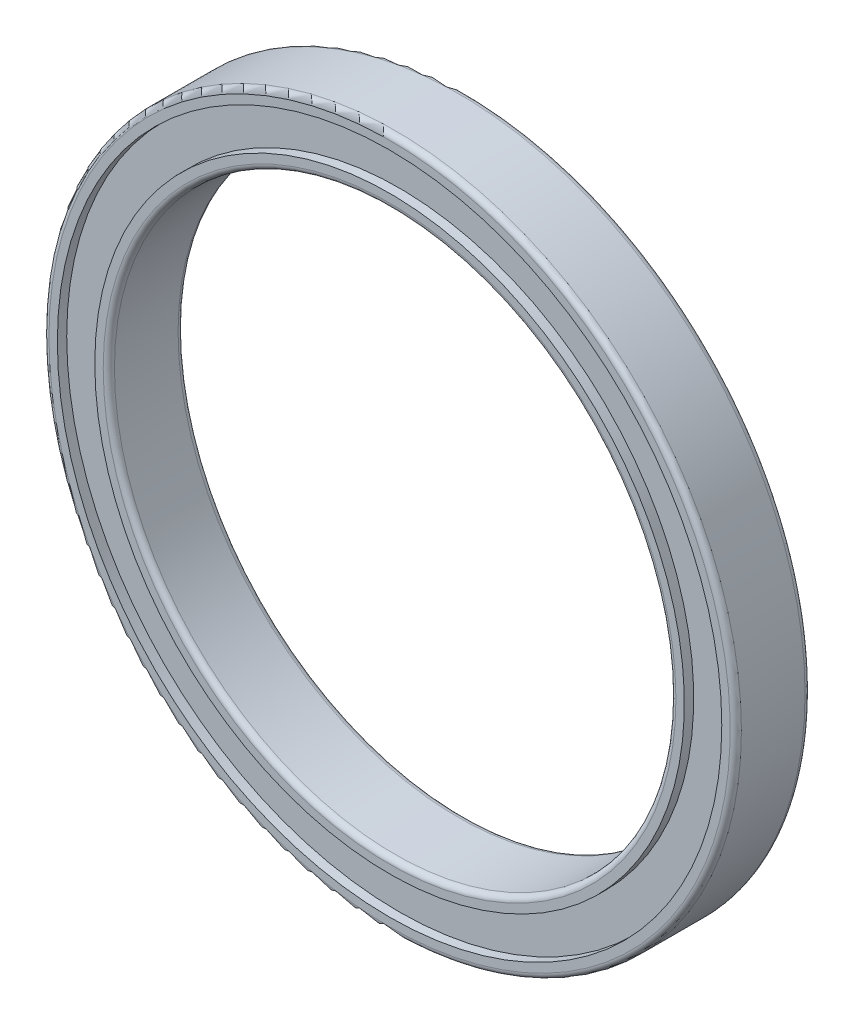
ISO-10303-21;
HEADER;
FILE_DESCRIPTION(('STEP AP214'),'2;1');
FILE_NAME('part.step','',(''),(''),'','','');
FILE_SCHEMA(('AUTOMOTIVE_DESIGN { 1 0 10303 214 1 1 1 1 }'));
ENDSEC;
DATA;
#1=APPLICATION_CONTEXT('core data for automotive mechanical design processes');
#2=APPLICATION_PROTOCOL_DEFINITION('international standard','automotive_design',2000,#1);
#3=PRODUCT_CONTEXT('',#1,'mechanical');
#4=PRODUCT('Part','Part','',(#3));
#5=PRODUCT_RELATED_PRODUCT_CATEGORY('part','',(#4));
#6=PRODUCT_DEFINITION_FORMATION('','',#4);
#7=PRODUCT_DEFINITION_CONTEXT('part definition',#1,'design');
#8=PRODUCT_DEFINITION('design','',#6,#7);
#9=PRODUCT_DEFINITION_SHAPE('','',#8);
#10=(LENGTH_UNIT() NAMED_UNIT(*) SI_UNIT(.MILLI.,.METRE.));
#11=(NAMED_UNIT(*) PLANE_ANGLE_UNIT() SI_UNIT($,.RADIAN.));
#12=(NAMED_UNIT(*) SI_UNIT($,.STERADIAN.) SOLID_ANGLE_UNIT());
#13=UNCERTAINTY_MEASURE_WITH_UNIT(LENGTH_MEASURE(1.E-05),#10,'distance_accuracy_value','');
#14=(GEOMETRIC_REPRESENTATION_CONTEXT(3) GLOBAL_UNCERTAINTY_ASSIGNED_CONTEXT((#13)) GLOBAL_UNIT_ASSIGNED_CONTEXT((#10,
#11,#12)) REPRESENTATION_CONTEXT('',''));
#15=CARTESIAN_POINT('',(0.,0.,0.));
#16=DIRECTION('',(0.,0.,1.));
#17=DIRECTION('',(1.,0.,0.));
#18=AXIS2_PLACEMENT_3D('',#15,#16,#17);
#19=CARTESIAN_POINT('',(0.,0.,0.3));
#20=DIRECTION('',(0.,0.,1.));
#21=DIRECTION('',(1.,0.,0.));
#22=AXIS2_PLACEMENT_3D('',#19,#20,#21);
#23=TOROIDAL_SURFACE('',#22,18.2,0.3);
#24=CARTESIAN_POINT('',(0.,0.,0.3));
#25=DIRECTION('',(0.,0.,1.));
#26=DIRECTION('',(1.,0.,0.));
#27=AXIS2_PLACEMENT_3D('',#24,#25,#26);
#28=CIRCLE('',#27,18.5);
#29=CARTESIAN_POINT('',(-18.5,0.,0.3));
#30=VERTEX_POINT('',#29);
#31=CARTESIAN_POINT('',(18.5,0.,0.3));
#32=VERTEX_POINT('',#31);
#33=EDGE_CURVE('E488',#30,#32,#28,.T.);
#34=ORIENTED_EDGE('',*,*,#33,.F.);
#35=CARTESIAN_POINT('',(-18.2,0.,0.3));
#36=DIRECTION('',(0.,-1.,0.));
#37=DIRECTION('',(-1.,0.,0.));
#38=AXIS2_PLACEMENT_3D('',#35,#36,#37);
#39=CIRCLE('',#38,0.3);
#40=CARTESIAN_POINT('',(-18.2,0.,0.));
#41=VERTEX_POINT('',#40);
#42=EDGE_CURVE('E11',#30,#41,#39,.T.);
#43=ORIENTED_EDGE('',*,*,#42,.T.);
#44=CARTESIAN_POINT('',(0.,0.,0.));
#45=DIRECTION('',(0.,0.,1.));
#46=DIRECTION('',(-1.,0.,0.));
#47=AXIS2_PLACEMENT_3D('',#44,#45,#46);
#48=CIRCLE('',#47,18.2);
#49=EDGE_CURVE('E25',#41,#41,#48,.T.);
#50=ORIENTED_EDGE('',*,*,#49,.T.);
#51=ORIENTED_EDGE('',*,*,#42,.F.);
#52=CARTESIAN_POINT('',(0.,0.,0.3));
#53=DIRECTION('',(0.,0.,1.));
#54=DIRECTION('',(1.,0.,0.));
#55=AXIS2_PLACEMENT_3D('',#52,#53,#54);
#56=CIRCLE('',#55,18.5);
#57=EDGE_CURVE('E270',#32,#30,#56,.T.);
#58=ORIENTED_EDGE('',*,*,#57,.F.);
#59=EDGE_LOOP('',(#34,#43,#50,#51,#58));
#60=FACE_BOUND('',#59,.T.);
#61=ADVANCED_FACE('F17',(#60),#23,.T.);
#62=CARTESIAN_POINT('',(0.,0.,0.));
#63=DIRECTION('',(0.,0.,1.));
#64=DIRECTION('',(1.,0.,0.));
#65=AXIS2_PLACEMENT_3D('',#62,#63,#64);
#66=PLANE('',#65);
#67=CARTESIAN_POINT('',(0.,0.,0.));
#68=DIRECTION('',(0.,0.,-1.));
#69=DIRECTION('',(1.,0.,0.));
#70=AXIS2_PLACEMENT_3D('',#67,#68,#69);
#71=CIRCLE('',#70,17.75);
#72=CARTESIAN_POINT('',(17.75,0.,0.));
#73=VERTEX_POINT('',#72);
#74=EDGE_CURVE('E44',#73,#73,#71,.T.);
#75=ORIENTED_EDGE('',*,*,#74,.F.);
#76=EDGE_LOOP('',(#75));
#77=FACE_BOUND('',#76,.T.);
#78=ORIENTED_EDGE('',*,*,#49,.F.);
#79=EDGE_LOOP('',(#78));
#80=FACE_BOUND('',#79,.T.);
#81=ADVANCED_FACE('F188',(#77,#80),#66,.F.);
#82=CARTESIAN_POINT('',(0.,0.,0.5));
#83=DIRECTION('',(0.,0.,-1.));
#84=DIRECTION('',(-1.,0.,0.));
#85=AXIS2_PLACEMENT_3D('',#82,#83,#84);
#86=CYLINDRICAL_SURFACE('',#85,17.75);
#87=CARTESIAN_POINT('',(0.,0.,0.5));
#88=DIRECTION('',(0.,0.,1.));
#89=DIRECTION('',(1.,0.,0.));
#90=AXIS2_PLACEMENT_3D('',#87,#88,#89);
#91=CIRCLE('',#90,17.75);
#92=CARTESIAN_POINT('',(17.75,0.,0.5));
#93=VERTEX_POINT('',#92);
#94=EDGE_CURVE('E174',#93,#93,#91,.T.);
#95=ORIENTED_EDGE('',*,*,#94,.T.);
#96=DIRECTION('',(0.,0.,-1.));
#97=VECTOR('',#96,1.);
#98=CARTESIAN_POINT('',(17.75,0.,0.5));
#99=LINE('',#98,#97);
#100=EDGE_CURVE('E177',#93,#73,#99,.T.);
#101=ORIENTED_EDGE('',*,*,#100,.T.);
#102=ORIENTED_EDGE('',*,*,#74,.T.);
#103=ORIENTED_EDGE('',*,*,#100,.F.);
#104=EDGE_LOOP('',(#95,#101,#102,#103));
#105=FACE_BOUND('',#104,.T.);
#106=ADVANCED_FACE('F190',(#105),#86,.F.);
#107=CARTESIAN_POINT('',(0.,0.,0.5));
#108=DIRECTION('',(0.,0.,-1.));
#109=DIRECTION('',(0.,-1.,0.));
#110=AXIS2_PLACEMENT_3D('',#107,#108,#109);
#111=PLANE('',#110);
#112=CARTESIAN_POINT('',(0.,0.,0.5));
#113=DIRECTION('',(0.,0.,-1.));
#114=DIRECTION('',(-1.,0.,0.));
#115=AXIS2_PLACEMENT_3D('',#112,#113,#114);
#116=CIRCLE('',#115,15.75);
#117=CARTESIAN_POINT('',(15.75,0.,0.5));
#118=VERTEX_POINT('',#117);
#119=EDGE_CURVE('E171',#118,#118,#116,.T.);
#120=ORIENTED_EDGE('',*,*,#119,.F.);
#121=EDGE_LOOP('',(#120));
#122=FACE_BOUND('',#121,.T.);
#123=ORIENTED_EDGE('',*,*,#94,.F.);
#124=EDGE_LOOP('',(#123));
#125=FACE_BOUND('',#124,.T.);
#126=ADVANCED_FACE('F199',(#122,#125),#111,.T.);
#127=CARTESIAN_POINT('',(0.,0.,0.5));
#128=DIRECTION('',(0.,0.,-1.));
#129=DIRECTION('',(-1.,0.,0.));
#130=AXIS2_PLACEMENT_3D('',#127,#128,#129);
#131=CYLINDRICAL_SURFACE('',#130,15.75);
#132=CARTESIAN_POINT('',(0.,0.,0.));
#133=DIRECTION('',(0.,0.,1.));
#134=DIRECTION('',(1.,0.,0.));
#135=AXIS2_PLACEMENT_3D('',#132,#133,#134);
#136=CIRCLE('',#135,15.75);
#137=CARTESIAN_POINT('',(15.75,0.,0.));
#138=VERTEX_POINT('',#137);
#139=EDGE_CURVE('E163',#138,#138,#136,.T.);
#140=ORIENTED_EDGE('',*,*,#139,.T.);
#141=DIRECTION('',(0.,0.,1.));
#142=VECTOR('',#141,1.);
#143=CARTESIAN_POINT('',(15.75,0.,0.5));
#144=LINE('',#143,#142);
#145=EDGE_CURVE('E167',#138,#118,#144,.T.);
#146=ORIENTED_EDGE('',*,*,#145,.T.);
#147=ORIENTED_EDGE('',*,*,#119,.T.);
#148=ORIENTED_EDGE('',*,*,#145,.F.);
#149=EDGE_LOOP('',(#140,#146,#147,#148));
#150=FACE_BOUND('',#149,.T.);
#151=ADVANCED_FACE('F229',(#150),#131,.T.);
#152=CARTESIAN_POINT('',(0.,0.,0.));
#153=DIRECTION('',(0.,0.,1.));
#154=DIRECTION('',(1.,0.,0.));
#155=AXIS2_PLACEMENT_3D('',#152,#153,#154);
#156=PLANE('',#155);
#157=CARTESIAN_POINT('',(0.,0.,0.));
#158=DIRECTION('',(0.,0.,-1.));
#159=DIRECTION('',(-1.,0.,0.));
#160=AXIS2_PLACEMENT_3D('',#157,#158,#159);
#161=CIRCLE('',#160,15.3);
#162=CARTESIAN_POINT('',(-15.3,0.,0.));
#163=VERTEX_POINT('',#162);
#164=EDGE_CURVE('E150',#163,#163,#161,.T.);
#165=ORIENTED_EDGE('',*,*,#164,.F.);
#166=EDGE_LOOP('',(#165));
#167=FACE_BOUND('',#166,.T.);
#168=ORIENTED_EDGE('',*,*,#139,.F.);
#169=EDGE_LOOP('',(#168));
#170=FACE_BOUND('',#169,.T.);
#171=ADVANCED_FACE('F213',(#167,#170),#156,.F.);
#172=CARTESIAN_POINT('',(0.,0.,0.3));
#173=DIRECTION('',(0.,0.,1.));
#174=DIRECTION('',(1.,0.,0.));
#175=AXIS2_PLACEMENT_3D('',#172,#173,#174);
#176=TOROIDAL_SURFACE('',#175,15.3,0.3);
#177=ORIENTED_EDGE('',*,*,#164,.T.);
#178=CARTESIAN_POINT('',(-15.3,0.,0.3));
#179=DIRECTION('',(0.,-1.,0.));
#180=DIRECTION('',(-1.,0.,0.));
#181=AXIS2_PLACEMENT_3D('',#178,#179,#180);
#182=CIRCLE('',#181,0.3);
#183=CARTESIAN_POINT('',(-15.,0.,0.3));
#184=VERTEX_POINT('',#183);
#185=EDGE_CURVE('E154',#163,#184,#182,.T.);
#186=ORIENTED_EDGE('',*,*,#185,.T.);
#187=CARTESIAN_POINT('',(0.,0.,0.3));
#188=DIRECTION('',(0.,0.,-1.));
#189=DIRECTION('',(1.,0.,0.));
#190=AXIS2_PLACEMENT_3D('',#187,#188,#189);
#191=CIRCLE('',#190,15.);
#192=CARTESIAN_POINT('',(15.,0.,0.3));
#193=VERTEX_POINT('',#192);
#194=EDGE_CURVE('E149',#193,#184,#191,.T.);
#195=ORIENTED_EDGE('',*,*,#194,.F.);
#196=CARTESIAN_POINT('',(0.,0.,0.3));
#197=DIRECTION('',(0.,0.,-1.));
#198=DIRECTION('',(1.,0.,0.));
#199=AXIS2_PLACEMENT_3D('',#196,#197,#198);
#200=CIRCLE('',#199,15.);
#201=EDGE_CURVE('E155',#184,#193,#200,.T.);
#202=ORIENTED_EDGE('',*,*,#201,.F.);
#203=ORIENTED_EDGE('',*,*,#185,.F.);
#204=EDGE_LOOP('',(#177,#186,#195,#202,#203));
#205=FACE_BOUND('',#204,.T.);
#206=ADVANCED_FACE('F209',(#205),#176,.T.);
#207=CARTESIAN_POINT('',(0.,0.,4.));
#208=DIRECTION('',(0.,0.,-1.));
#209=DIRECTION('',(-1.,0.,0.));
#210=AXIS2_PLACEMENT_3D('',#207,#208,#209);
#211=CYLINDRICAL_SURFACE('',#210,15.);
#212=CARTESIAN_POINT('',(0.,0.,3.7));
#213=DIRECTION('',(0.,0.,1.));
#214=DIRECTION('',(1.,0.,0.));
#215=AXIS2_PLACEMENT_3D('',#212,#213,#214);
#216=CIRCLE('',#215,15.);
#217=CARTESIAN_POINT('',(15.,0.,3.7));
#218=VERTEX_POINT('',#217);
#219=CARTESIAN_POINT('',(-15.,0.,3.7));
#220=VERTEX_POINT('',#219);
#221=EDGE_CURVE('E133',#218,#220,#216,.T.);
#222=ORIENTED_EDGE('',*,*,#221,.T.);
#223=CARTESIAN_POINT('',(0.,0.,3.7));
#224=DIRECTION('',(0.,0.,1.));
#225=DIRECTION('',(1.,0.,0.));
#226=AXIS2_PLACEMENT_3D('',#223,#224,#225);
#227=CIRCLE('',#226,15.);
#228=EDGE_CURVE('E138',#220,#218,#227,.T.);
#229=ORIENTED_EDGE('',*,*,#228,.T.);
#230=DIRECTION('',(0.,0.,-1.));
#231=VECTOR('',#230,1.);
#232=CARTESIAN_POINT('',(15.,0.,4.));
#233=LINE('',#232,#231);
#234=EDGE_CURVE('E145',#218,#193,#233,.T.);
#235=ORIENTED_EDGE('',*,*,#234,.T.);
#236=ORIENTED_EDGE('',*,*,#194,.T.);
#237=ORIENTED_EDGE('',*,*,#201,.T.);
#238=ORIENTED_EDGE('',*,*,#234,.F.);
#239=EDGE_LOOP('',(#222,#229,#235,#236,#237,#238));
#240=FACE_BOUND('',#239,.T.);
#241=ADVANCED_FACE('F212',(#240),#211,.F.);
#242=CARTESIAN_POINT('',(0.,0.,3.7));
#243=DIRECTION('',(0.,0.,1.));
#244=DIRECTION('',(1.,0.,0.));
#245=AXIS2_PLACEMENT_3D('',#242,#243,#244);
#246=TOROIDAL_SURFACE('',#245,15.3,0.3);
#247=ORIENTED_EDGE('',*,*,#221,.F.);
#248=ORIENTED_EDGE('',*,*,#228,.F.);
#249=CARTESIAN_POINT('',(-15.3,0.,3.7));
#250=DIRECTION('',(0.,-1.,0.));
#251=DIRECTION('',(-1.,0.,0.));
#252=AXIS2_PLACEMENT_3D('',#249,#250,#251);
#253=CIRCLE('',#252,0.3);
#254=CARTESIAN_POINT('',(-15.3,0.,4.));
#255=VERTEX_POINT('',#254);
#256=EDGE_CURVE('E142',#220,#255,#253,.T.);
#257=ORIENTED_EDGE('',*,*,#256,.T.);
#258=CARTESIAN_POINT('',(0.,0.,4.));
#259=DIRECTION('',(0.,0.,1.));
#260=DIRECTION('',(-1.,0.,0.));
#261=AXIS2_PLACEMENT_3D('',#258,#259,#260);
#262=CIRCLE('',#261,15.3);
#263=EDGE_CURVE('E125',#255,#255,#262,.T.);
#264=ORIENTED_EDGE('',*,*,#263,.T.);
#265=ORIENTED_EDGE('',*,*,#256,.F.);
#266=EDGE_LOOP('',(#247,#248,#257,#264,#265));
#267=FACE_BOUND('',#266,.T.);
#268=ADVANCED_FACE('F220',(#267),#246,.T.);
#269=CARTESIAN_POINT('',(0.,0.,4.));
#270=DIRECTION('',(0.,0.,1.));
#271=DIRECTION('',(1.,0.,0.));
#272=AXIS2_PLACEMENT_3D('',#269,#270,#271);
#273=PLANE('',#272);
#274=ORIENTED_EDGE('',*,*,#263,.F.);
#275=EDGE_LOOP('',(#274));
#276=FACE_BOUND('',#275,.T.);
#277=CARTESIAN_POINT('',(0.,0.,4.));
#278=DIRECTION('',(0.,0.,-1.));
#279=DIRECTION('',(-1.,0.,0.));
#280=AXIS2_PLACEMENT_3D('',#277,#278,#279);
#281=CIRCLE('',#280,15.75);
#282=CARTESIAN_POINT('',(-15.75,0.,4.));
#283=VERTEX_POINT('',#282);
#284=EDGE_CURVE('E123',#283,#283,#281,.T.);
#285=ORIENTED_EDGE('',*,*,#284,.F.);
#286=EDGE_LOOP('',(#285));
#287=FACE_BOUND('',#286,.T.);
#288=ADVANCED_FACE('F217',(#276,#287),#273,.T.);
#289=CARTESIAN_POINT('',(0.,0.,3.5));
#290=DIRECTION('',(0.,0.,1.));
#291=DIRECTION('',(1.,0.,0.));
#292=AXIS2_PLACEMENT_3D('',#289,#290,#291);
#293=CYLINDRICAL_SURFACE('',#292,15.75);
#294=ORIENTED_EDGE('',*,*,#284,.T.);
#295=DIRECTION('',(0.,0.,-1.));
#296=VECTOR('',#295,1.);
#297=CARTESIAN_POINT('',(-15.75,0.,3.5));
#298=LINE('',#297,#296);
#299=CARTESIAN_POINT('',(-15.75,0.,3.5));
#300=VERTEX_POINT('',#299);
#301=EDGE_CURVE('E118',#283,#300,#298,.T.);
#302=ORIENTED_EDGE('',*,*,#301,.T.);
#303=CARTESIAN_POINT('',(0.,0.,3.5));
#304=DIRECTION('',(0.,0.,1.));
#305=DIRECTION('',(1.,0.,0.));
#306=AXIS2_PLACEMENT_3D('',#303,#304,#305);
#307=CIRCLE('',#306,15.75);
#308=EDGE_CURVE('E121',#300,#300,#307,.T.);
#309=ORIENTED_EDGE('',*,*,#308,.T.);
#310=ORIENTED_EDGE('',*,*,#301,.F.);
#311=EDGE_LOOP('',(#294,#302,#309,#310));
#312=FACE_BOUND('',#311,.T.);
#313=ADVANCED_FACE('F119',(#312),#293,.T.);
#314=CARTESIAN_POINT('',(0.,0.,3.5));
#315=DIRECTION('',(0.,0.,1.));
#316=DIRECTION('',(1.,0.,0.));
#317=AXIS2_PLACEMENT_3D('',#314,#315,#316);
#318=PLANE('',#317);
#319=ORIENTED_EDGE('',*,*,#308,.F.);
#320=EDGE_LOOP('',(#319));
#321=FACE_BOUND('',#320,.T.);
#322=CARTESIAN_POINT('',(0.,0.,3.5));
#323=DIRECTION('',(0.,0.,-1.));
#324=DIRECTION('',(-1.,0.,0.));
#325=AXIS2_PLACEMENT_3D('',#322,#323,#324);
#326=CIRCLE('',#325,17.75);
#327=CARTESIAN_POINT('',(-17.75,0.,3.5));
#328=VERTEX_POINT('',#327);
#329=EDGE_CURVE('E280',#328,#328,#326,.T.);
#330=ORIENTED_EDGE('',*,*,#329,.F.);
#331=EDGE_LOOP('',(#330));
#332=FACE_BOUND('',#331,.T.);
#333=ADVANCED_FACE('F205',(#321,#332),#318,.T.);
#334=CARTESIAN_POINT('',(0.,0.,3.5));
#335=DIRECTION('',(0.,0.,1.));
#336=DIRECTION('',(1.,0.,0.));
#337=AXIS2_PLACEMENT_3D('',#334,#335,#336);
#338=CYLINDRICAL_SURFACE('',#337,17.75);
#339=ORIENTED_EDGE('',*,*,#329,.T.);
#340=DIRECTION('',(0.,0.,1.));
#341=VECTOR('',#340,1.);
#342=CARTESIAN_POINT('',(-17.75,0.,3.5));
#343=LINE('',#342,#341);
#344=CARTESIAN_POINT('',(-17.75,0.,4.));
#345=VERTEX_POINT('',#344);
#346=EDGE_CURVE('E284',#328,#345,#343,.T.);
#347=ORIENTED_EDGE('',*,*,#346,.T.);
#348=CARTESIAN_POINT('',(0.,0.,4.));
#349=DIRECTION('',(0.,0.,1.));
#350=DIRECTION('',(1.,0.,0.));
#351=AXIS2_PLACEMENT_3D('',#348,#349,#350);
#352=CIRCLE('',#351,17.75);
#353=EDGE_CURVE('E264',#345,#345,#352,.T.);
#354=ORIENTED_EDGE('',*,*,#353,.T.);
#355=ORIENTED_EDGE('',*,*,#346,.F.);
#356=EDGE_LOOP('',(#339,#347,#354,#355));
#357=FACE_BOUND('',#356,.T.);
#358=ADVANCED_FACE('F202',(#357),#338,.F.);
#359=CARTESIAN_POINT('',(0.,0.,4.));
#360=DIRECTION('',(0.,0.,1.));
#361=DIRECTION('',(1.,0.,0.));
#362=AXIS2_PLACEMENT_3D('',#359,#360,#361);
#363=PLANE('',#362);
#364=ORIENTED_EDGE('',*,*,#353,.F.);
#365=EDGE_LOOP('',(#364));
#366=FACE_BOUND('',#365,.T.);
#367=CARTESIAN_POINT('',(0.,0.,4.));
#368=DIRECTION('',(0.,0.,-1.));
#369=DIRECTION('',(-1.,0.,0.));
#370=AXIS2_PLACEMENT_3D('',#367,#368,#369);
#371=CIRCLE('',#370,18.2);
#372=CARTESIAN_POINT('',(-18.2,0.,4.));
#373=VERTEX_POINT('',#372);
#374=EDGE_CURVE('E267',#373,#373,#371,.T.);
#375=ORIENTED_EDGE('',*,*,#374,.F.);
#376=EDGE_LOOP('',(#375));
#377=FACE_BOUND('',#376,.T.);
#378=ADVANCED_FACE('F252',(#366,#377),#363,.T.);
#379=CARTESIAN_POINT('',(0.,0.,3.7));
#380=DIRECTION('',(0.,0.,1.));
#381=DIRECTION('',(1.,0.,0.));
#382=AXIS2_PLACEMENT_3D('',#379,#380,#381);
#383=TOROIDAL_SURFACE('',#382,18.2,0.3);
#384=ORIENTED_EDGE('',*,*,#374,.T.);
#385=CARTESIAN_POINT('',(-18.2,0.,3.7));
#386=DIRECTION('',(0.,-1.,0.));
#387=DIRECTION('',(-1.,0.,0.));
#388=AXIS2_PLACEMENT_3D('',#385,#386,#387);
#389=CIRCLE('',#388,0.3);
#390=CARTESIAN_POINT('',(-18.5,0.,3.7));
#391=VERTEX_POINT('',#390);
#392=EDGE_CURVE('E269',#373,#391,#389,.T.);
#393=ORIENTED_EDGE('',*,*,#392,.T.);
#394=CARTESIAN_POINT('',(0.,0.,3.7));
#395=DIRECTION('',(0.,0.,-1.));
#396=DIRECTION('',(1.,0.,0.));
#397=AXIS2_PLACEMENT_3D('',#394,#395,#396);
#398=CIRCLE('',#397,18.5);
#399=CARTESIAN_POINT('',(18.5,0.,3.7));
#400=VERTEX_POINT('',#399);
#401=EDGE_CURVE('E295',#400,#391,#398,.T.);
#402=ORIENTED_EDGE('',*,*,#401,.F.);
#403=CARTESIAN_POINT('',(0.,0.,3.7));
#404=DIRECTION('',(0.,0.,-1.));
#405=DIRECTION('',(1.,0.,0.));
#406=AXIS2_PLACEMENT_3D('',#403,#404,#405);
#407=CIRCLE('',#406,18.5);
#408=EDGE_CURVE('E277',#391,#400,#407,.T.);
#409=ORIENTED_EDGE('',*,*,#408,.F.);
#410=ORIENTED_EDGE('',*,*,#392,.F.);
#411=EDGE_LOOP('',(#384,#393,#402,#409,#410));
#412=FACE_BOUND('',#411,.T.);
#413=ADVANCED_FACE('F250',(#412),#383,.T.);
#414=CARTESIAN_POINT('',(0.,0.,4.));
#415=DIRECTION('',(0.,0.,-1.));
#416=DIRECTION('',(-1.,0.,0.));
#417=AXIS2_PLACEMENT_3D('',#414,#415,#416);
#418=CYLINDRICAL_SURFACE('',#417,18.5);
#419=ORIENTED_EDGE('',*,*,#33,.T.);
#420=DIRECTION('',(0.,0.,1.));
#421=VECTOR('',#420,1.);
#422=CARTESIAN_POINT('',(18.5,0.,4.));
#423=LINE('',#422,#421);
#424=EDGE_CURVE('E491',#32,#400,#423,.T.);
#425=ORIENTED_EDGE('',*,*,#424,.T.);
#426=ORIENTED_EDGE('',*,*,#401,.T.);
#427=ORIENTED_EDGE('',*,*,#408,.T.);
#428=ORIENTED_EDGE('',*,*,#424,.F.);
#429=ORIENTED_EDGE('',*,*,#57,.T.);
#430=EDGE_LOOP('',(#419,#425,#426,#427,#428,#429));
#431=FACE_BOUND('',#430,.T.);
#432=ADVANCED_FACE('F249',(#431),#418,.T.);
#433=CLOSED_SHELL('',(#61,#81,#106,#126,#151,#171,#206,#241,#268,#288,#313,#333,#358,#378,#413,#432));
#434=MANIFOLD_SOLID_BREP('B1',#433);
#435=ADVANCED_BREP_SHAPE_REPRESENTATION('',(#18,#434),#14);
#436=SHAPE_DEFINITION_REPRESENTATION(#9,#435);
ENDSEC;
END-ISO-10303-21;
